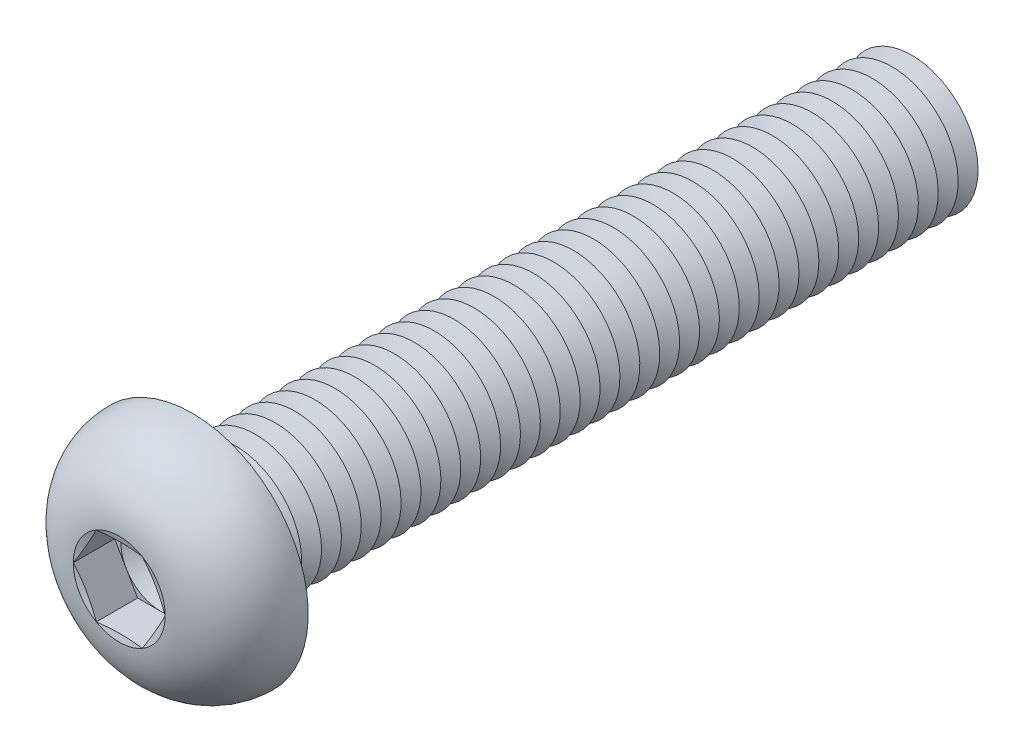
from build123d import *

# Parameters (mm, degrees)
FILLET1_R          = 0.75
LPATTERN1_COUNT    = 36
LPATTERN1_PITCH    = 1.5
CUT_EXTRUDE1_DEPTH = 3.12


with BuildPart() as part:
    # Sketch1 → Revolve1 (revolve)
    with BuildSketch(Plane(origin=(0, 0, 0), x_dir=(0, 0, -1), z_dir=(1, 0, 0))):
        with BuildLine():
            Line((0, 5), (0, 8.75))
            ThreePointArc((0, 8.75), (-3.814142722, 7.21429474), (-5.5, 3.4641))
            Line((-5.5, 3.4641), (-5.035898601, 1.73205))
            Line((-5.035898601, 1.73205), (-5.5, 1.73205))
            Line((-5.5, 1.73205), (-5.5, 0))
            Line((-5.5, 0), (55, 0))
            Line((55, 0), (55, 5))
            Line((55, 5), (0, 5))
        make_face()
    revolve(axis=Axis((0, 0, -55), (0, 0, 1)))

    # Fillet1
    fillet1_edges = [part.edges().sort_by_distance(p)[0] for p in [
        (0, -5, 0),
    ]]
    fillet(fillet1_edges, radius=FILLET1_R)

    # Sketch2 → Cut-Revolve1 (revolve, cut)
    with BuildSketch(Plane(origin=(0, 0, 0), x_dir=(0, 0, -1), z_dir=(1, 0, 0))):
        Polygon((54.25, 5), (55.75, 5), (55, 3.700961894), align=None)
    cut_revolve1 = revolve(axis=Axis((0, 0, -55), (0, 0, -1)), mode=Mode.SUBTRACT)

    # LPattern1: Cut-Revolve1 ×36
    with Locations(*[(0, 0, i * LPATTERN1_PITCH) for i in range(1, LPATTERN1_COUNT)]):
        add(cut_revolve1, mode=Mode.SUBTRACT)

    # Sketch3 → Cut-Extrude1 (cut)
    with BuildSketch(Plane.XY.offset(5.5)):
        Polygon((1.73205, 2.999998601), (-1.73205, 2.999998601), (-3.4641, 0), (-1.73205, -2.999998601), (1.73205, -2.999998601), (3.4641, 0), align=None)
    extrude(amount=-CUT_EXTRUDE1_DEPTH, mode=Mode.SUBTRACT)

    # Cut-Extrude2 cone 1 section (on through the dimple's axis) → Cut-Extrude2 (revolve, cut)
    with BuildSketch(Plane(origin=(0, 0, 2.38), x_dir=(0, -1, 0), z_dir=(1, 0, 0))):
        Polygon((0, 0), (2.999998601, 0), (0, 1.73205), align=None)
    revolve(axis=Axis((0, 0, 2.38), (0, 0, -1)), mode=Mode.SUBTRACT)


solid = part.part
